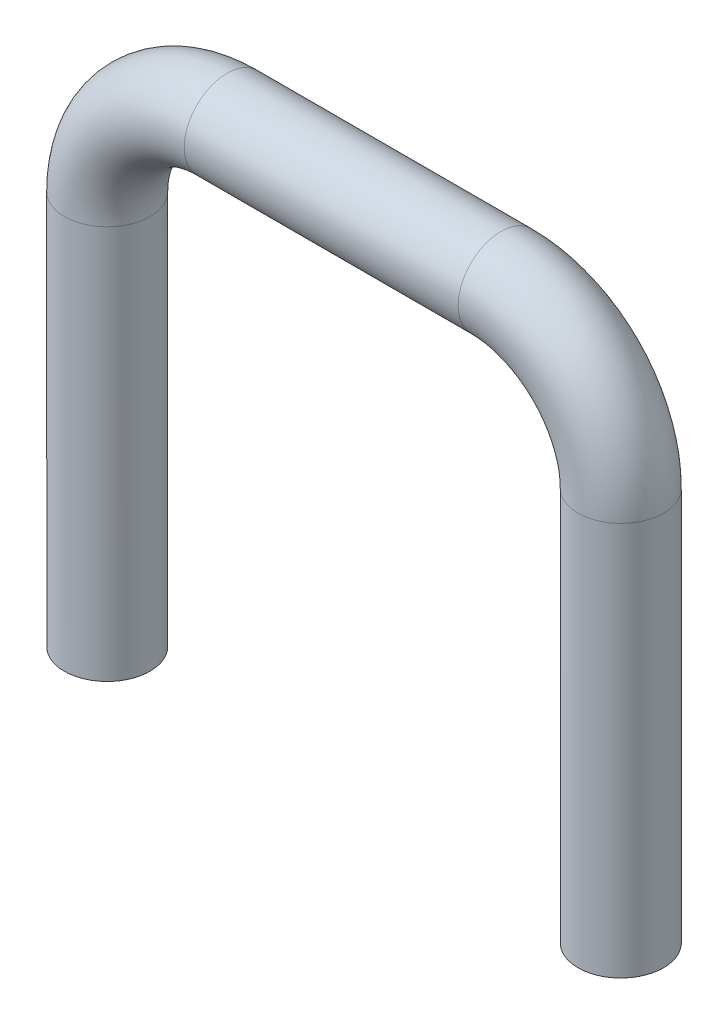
from build123d import *

# Parameters (mm, degrees)
SKETCH2_R = 2.5


with BuildPart() as part:
    # Base-Sweep: sweep along a path in Sketch1
    with BuildLine(Plane.XY) as base_sweep_path:
        Line((15, 0), (15, 23))
        ThreePointArc((15, 23), (12.949747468, 27.949747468), (8, 30))
        Line((8, 30), (-8, 30))
        ThreePointArc((-8, 30), (-12.949747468, 27.949747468), (-15, 23))
        Line((-15, 23), (-15, 0))
    # Sketch2 → Base-Sweep (sweep)
    with BuildSketch(Plane(origin=(0, 0, 0), x_dir=(1, 0, 0), z_dir=(0, 1, 0))):
        with Locations((15, 0)):
            Circle(SKETCH2_R)
    sweep(path=base_sweep_path.line)


solid = part.part
